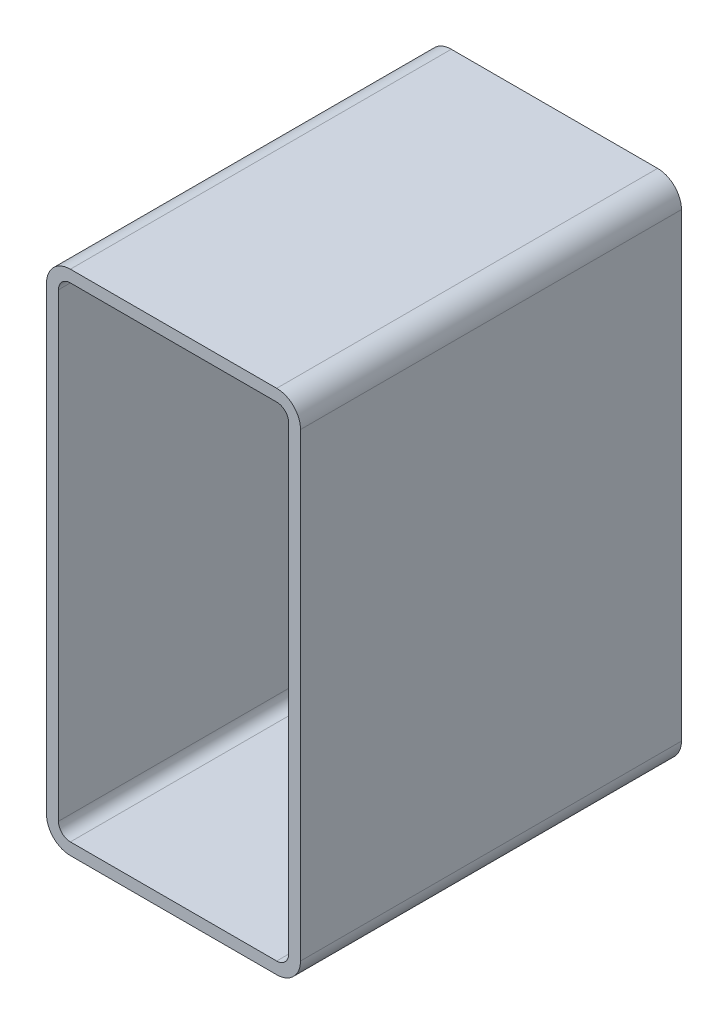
ISO-10303-21;
HEADER;
FILE_DESCRIPTION(('STEP AP214'),'2;1');
FILE_NAME('part.step','',(''),(''),'','','');
FILE_SCHEMA(('AUTOMOTIVE_DESIGN { 1 0 10303 214 1 1 1 1 }'));
ENDSEC;
DATA;
#1=APPLICATION_CONTEXT('core data for automotive mechanical design processes');
#2=APPLICATION_PROTOCOL_DEFINITION('international standard','automotive_design',2000,#1);
#3=PRODUCT_CONTEXT('',#1,'mechanical');
#4=PRODUCT('Part','Part','',(#3));
#5=PRODUCT_RELATED_PRODUCT_CATEGORY('part','',(#4));
#6=PRODUCT_DEFINITION_FORMATION('','',#4);
#7=PRODUCT_DEFINITION_CONTEXT('part definition',#1,'design');
#8=PRODUCT_DEFINITION('design','',#6,#7);
#9=PRODUCT_DEFINITION_SHAPE('','',#8);
#10=(LENGTH_UNIT() NAMED_UNIT(*) SI_UNIT(.MILLI.,.METRE.));
#11=(NAMED_UNIT(*) PLANE_ANGLE_UNIT() SI_UNIT($,.RADIAN.));
#12=(NAMED_UNIT(*) SI_UNIT($,.STERADIAN.) SOLID_ANGLE_UNIT());
#13=UNCERTAINTY_MEASURE_WITH_UNIT(LENGTH_MEASURE(1.E-05),#10,'distance_accuracy_value','');
#14=(GEOMETRIC_REPRESENTATION_CONTEXT(3) GLOBAL_UNCERTAINTY_ASSIGNED_CONTEXT((#13)) GLOBAL_UNIT_ASSIGNED_CONTEXT((#10,
#11,#12)) REPRESENTATION_CONTEXT('',''));
#15=CARTESIAN_POINT('',(0.,0.,0.));
#16=DIRECTION('',(0.,0.,1.));
#17=DIRECTION('',(1.,0.,0.));
#18=AXIS2_PLACEMENT_3D('',#15,#16,#17);
#19=CARTESIAN_POINT('',(20.4409404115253,389.132862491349,304.8));
#20=DIRECTION('',(0.,0.,1.));
#21=DIRECTION('',(1.,0.,0.));
#22=AXIS2_PLACEMENT_3D('',#19,#20,#21);
#23=PLANE('',#22);
#24=CARTESIAN_POINT('',(20.4409404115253,389.132862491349,304.8));
#25=DIRECTION('',(0.,0.,1.));
#26=DIRECTION('',(1.,0.,0.));
#27=AXIS2_PLACEMENT_3D('',#24,#25,#26);
#28=CIRCLE('',#27,19.05);
#29=CARTESIAN_POINT('',(20.4409404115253,408.182862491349,304.8));
#30=VERTEX_POINT('',#29);
#31=CARTESIAN_POINT('',(1.3909404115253,389.132862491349,304.8));
#32=VERTEX_POINT('',#31);
#33=EDGE_CURVE('E211',#30,#32,#28,.T.);
#34=ORIENTED_EDGE('',*,*,#33,.T.);
#35=DIRECTION('',(0.,-1.,0.));
#36=VECTOR('',#35,1.);
#37=CARTESIAN_POINT('',(1.3909404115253,20.8328624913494,304.8));
#38=LINE('',#37,#36);
#39=CARTESIAN_POINT('',(1.3909404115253,20.8328624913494,304.8));
#40=VERTEX_POINT('',#39);
#41=EDGE_CURVE('E214',#32,#40,#38,.T.);
#42=ORIENTED_EDGE('',*,*,#41,.T.);
#43=CARTESIAN_POINT('',(20.4409404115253,20.8328624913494,304.8));
#44=DIRECTION('',(0.,0.,1.));
#45=DIRECTION('',(1.,0.,0.));
#46=AXIS2_PLACEMENT_3D('',#43,#44,#45);
#47=CIRCLE('',#46,19.05);
#48=CARTESIAN_POINT('',(20.4409404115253,1.78286249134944,304.8));
#49=VERTEX_POINT('',#48);
#50=EDGE_CURVE('E217',#40,#49,#47,.T.);
#51=ORIENTED_EDGE('',*,*,#50,.T.);
#52=DIRECTION('',(1.,0.,0.));
#53=VECTOR('',#52,1.);
#54=CARTESIAN_POINT('',(185.540940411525,1.78286249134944,304.8));
#55=LINE('',#54,#53);
#56=CARTESIAN_POINT('',(185.540940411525,1.78286249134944,304.8));
#57=VERTEX_POINT('',#56);
#58=EDGE_CURVE('E219',#49,#57,#55,.T.);
#59=ORIENTED_EDGE('',*,*,#58,.T.);
#60=CARTESIAN_POINT('',(185.540940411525,20.8328624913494,304.8));
#61=DIRECTION('',(0.,0.,1.));
#62=DIRECTION('',(1.,0.,0.));
#63=AXIS2_PLACEMENT_3D('',#60,#61,#62);
#64=CIRCLE('',#63,19.05);
#65=CARTESIAN_POINT('',(204.590940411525,20.8328624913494,304.8));
#66=VERTEX_POINT('',#65);
#67=EDGE_CURVE('E221',#57,#66,#64,.T.);
#68=ORIENTED_EDGE('',*,*,#67,.T.);
#69=DIRECTION('',(0.,1.,0.));
#70=VECTOR('',#69,1.);
#71=CARTESIAN_POINT('',(204.590940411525,389.132862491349,304.8));
#72=LINE('',#71,#70);
#73=CARTESIAN_POINT('',(204.590940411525,389.132862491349,304.8));
#74=VERTEX_POINT('',#73);
#75=EDGE_CURVE('E223',#66,#74,#72,.T.);
#76=ORIENTED_EDGE('',*,*,#75,.T.);
#77=CARTESIAN_POINT('',(185.540940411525,389.132862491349,304.8));
#78=DIRECTION('',(0.,0.,1.));
#79=DIRECTION('',(1.,0.,0.));
#80=AXIS2_PLACEMENT_3D('',#77,#78,#79);
#81=CIRCLE('',#80,19.05);
#82=CARTESIAN_POINT('',(185.540940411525,408.182862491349,304.8));
#83=VERTEX_POINT('',#82);
#84=EDGE_CURVE('E225',#74,#83,#81,.T.);
#85=ORIENTED_EDGE('',*,*,#84,.T.);
#86=DIRECTION('',(-1.,0.,0.));
#87=VECTOR('',#86,1.);
#88=CARTESIAN_POINT('',(20.4409404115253,408.182862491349,304.8));
#89=LINE('',#88,#87);
#90=EDGE_CURVE('E227',#83,#30,#89,.T.);
#91=ORIENTED_EDGE('',*,*,#90,.T.);
#92=EDGE_LOOP('',(#34,#42,#51,#59,#68,#76,#85,#91));
#93=FACE_BOUND('',#92,.T.);
#94=DIRECTION('',(0.,-1.,0.));
#95=VECTOR('',#94,1.);
#96=CARTESIAN_POINT('',(10.9159404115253,20.8328624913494,304.8));
#97=LINE('',#96,#95);
#98=CARTESIAN_POINT('',(10.9159404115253,389.132862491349,304.8));
#99=VERTEX_POINT('',#98);
#100=CARTESIAN_POINT('',(10.9159404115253,20.8328624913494,304.8));
#101=VERTEX_POINT('',#100);
#102=EDGE_CURVE('E154',#99,#101,#97,.T.);
#103=ORIENTED_EDGE('',*,*,#102,.F.);
#104=CARTESIAN_POINT('',(20.4409404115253,389.132862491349,304.8));
#105=DIRECTION('',(0.,0.,1.));
#106=DIRECTION('',(1.,0.,0.));
#107=AXIS2_PLACEMENT_3D('',#104,#105,#106);
#108=CIRCLE('',#107,9.525);
#109=CARTESIAN_POINT('',(20.4409404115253,398.657862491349,304.8));
#110=VERTEX_POINT('',#109);
#111=EDGE_CURVE('E146',#110,#99,#108,.T.);
#112=ORIENTED_EDGE('',*,*,#111,.F.);
#113=DIRECTION('',(-1.,0.,0.));
#114=VECTOR('',#113,1.);
#115=CARTESIAN_POINT('',(20.4409404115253,398.657862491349,304.8));
#116=LINE('',#115,#114);
#117=CARTESIAN_POINT('',(185.540940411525,398.657862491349,304.8));
#118=VERTEX_POINT('',#117);
#119=EDGE_CURVE('E179',#118,#110,#116,.T.);
#120=ORIENTED_EDGE('',*,*,#119,.F.);
#121=CARTESIAN_POINT('',(185.540940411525,389.132862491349,304.8));
#122=DIRECTION('',(0.,0.,1.));
#123=DIRECTION('',(1.,0.,0.));
#124=AXIS2_PLACEMENT_3D('',#121,#122,#123);
#125=CIRCLE('',#124,9.52500000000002);
#126=CARTESIAN_POINT('',(195.065940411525,389.132862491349,304.8));
#127=VERTEX_POINT('',#126);
#128=EDGE_CURVE('E177',#127,#118,#125,.T.);
#129=ORIENTED_EDGE('',*,*,#128,.F.);
#130=DIRECTION('',(0.,1.,0.));
#131=VECTOR('',#130,1.);
#132=CARTESIAN_POINT('',(195.065940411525,389.132862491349,304.8));
#133=LINE('',#132,#131);
#134=CARTESIAN_POINT('',(195.065940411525,20.8328624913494,304.8));
#135=VERTEX_POINT('',#134);
#136=EDGE_CURVE('E175',#135,#127,#133,.T.);
#137=ORIENTED_EDGE('',*,*,#136,.F.);
#138=CARTESIAN_POINT('',(185.540940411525,20.8328624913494,304.8));
#139=DIRECTION('',(0.,0.,1.));
#140=DIRECTION('',(1.,0.,0.));
#141=AXIS2_PLACEMENT_3D('',#138,#139,#140);
#142=CIRCLE('',#141,9.52500000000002);
#143=CARTESIAN_POINT('',(185.540940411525,11.3078624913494,304.8));
#144=VERTEX_POINT('',#143);
#145=EDGE_CURVE('E173',#144,#135,#142,.T.);
#146=ORIENTED_EDGE('',*,*,#145,.F.);
#147=DIRECTION('',(1.,0.,0.));
#148=VECTOR('',#147,1.);
#149=CARTESIAN_POINT('',(185.540940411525,11.3078624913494,304.8));
#150=LINE('',#149,#148);
#151=CARTESIAN_POINT('',(20.4409404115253,11.3078624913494,304.8));
#152=VERTEX_POINT('',#151);
#153=EDGE_CURVE('E169',#152,#144,#150,.T.);
#154=ORIENTED_EDGE('',*,*,#153,.F.);
#155=CARTESIAN_POINT('',(20.4409404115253,20.8328624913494,304.8));
#156=DIRECTION('',(0.,0.,1.));
#157=DIRECTION('',(1.,0.,0.));
#158=AXIS2_PLACEMENT_3D('',#155,#156,#157);
#159=CIRCLE('',#158,9.525);
#160=EDGE_CURVE('E167',#101,#152,#159,.T.);
#161=ORIENTED_EDGE('',*,*,#160,.F.);
#162=EDGE_LOOP('',(#103,#112,#120,#129,#137,#146,#154,#161));
#163=FACE_BOUND('',#162,.T.);
#164=ADVANCED_FACE('F33',(#93,#163),#23,.T.);
#165=CARTESIAN_POINT('',(20.4409404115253,389.132862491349,0.));
#166=DIRECTION('',(0.,0.,1.));
#167=DIRECTION('',(1.,0.,0.));
#168=AXIS2_PLACEMENT_3D('',#165,#166,#167);
#169=PLANE('',#168);
#170=CARTESIAN_POINT('',(20.4409404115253,389.132862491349,0.));
#171=DIRECTION('',(0.,0.,1.));
#172=DIRECTION('',(1.,0.,0.));
#173=AXIS2_PLACEMENT_3D('',#170,#171,#172);
#174=CIRCLE('',#173,19.05);
#175=CARTESIAN_POINT('',(20.4409404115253,408.182862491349,0.));
#176=VERTEX_POINT('',#175);
#177=CARTESIAN_POINT('',(1.3909404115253,389.132862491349,0.));
#178=VERTEX_POINT('',#177);
#179=EDGE_CURVE('E162',#176,#178,#174,.T.);
#180=ORIENTED_EDGE('',*,*,#179,.F.);
#181=DIRECTION('',(-1.,0.,0.));
#182=VECTOR('',#181,1.);
#183=CARTESIAN_POINT('',(20.4409404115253,408.182862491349,0.));
#184=LINE('',#183,#182);
#185=CARTESIAN_POINT('',(185.540940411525,408.182862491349,0.));
#186=VERTEX_POINT('',#185);
#187=EDGE_CURVE('E215',#186,#176,#184,.T.);
#188=ORIENTED_EDGE('',*,*,#187,.F.);
#189=CARTESIAN_POINT('',(185.540940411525,389.132862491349,0.));
#190=DIRECTION('',(0.,0.,1.));
#191=DIRECTION('',(1.,0.,0.));
#192=AXIS2_PLACEMENT_3D('',#189,#190,#191);
#193=CIRCLE('',#192,19.05);
#194=CARTESIAN_POINT('',(204.590940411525,389.132862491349,0.));
#195=VERTEX_POINT('',#194);
#196=EDGE_CURVE('E242',#195,#186,#193,.T.);
#197=ORIENTED_EDGE('',*,*,#196,.F.);
#198=DIRECTION('',(0.,1.,0.));
#199=VECTOR('',#198,1.);
#200=CARTESIAN_POINT('',(204.590940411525,389.132862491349,0.));
#201=LINE('',#200,#199);
#202=CARTESIAN_POINT('',(204.590940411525,20.8328624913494,0.));
#203=VERTEX_POINT('',#202);
#204=EDGE_CURVE('E240',#203,#195,#201,.T.);
#205=ORIENTED_EDGE('',*,*,#204,.F.);
#206=CARTESIAN_POINT('',(185.540940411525,20.8328624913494,0.));
#207=DIRECTION('',(0.,0.,1.));
#208=DIRECTION('',(1.,0.,0.));
#209=AXIS2_PLACEMENT_3D('',#206,#207,#208);
#210=CIRCLE('',#209,19.05);
#211=CARTESIAN_POINT('',(185.540940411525,1.78286249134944,0.));
#212=VERTEX_POINT('',#211);
#213=EDGE_CURVE('E238',#212,#203,#210,.T.);
#214=ORIENTED_EDGE('',*,*,#213,.F.);
#215=DIRECTION('',(1.,0.,0.));
#216=VECTOR('',#215,1.);
#217=CARTESIAN_POINT('',(185.540940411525,1.78286249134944,0.));
#218=LINE('',#217,#216);
#219=CARTESIAN_POINT('',(20.4409404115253,1.78286249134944,0.));
#220=VERTEX_POINT('',#219);
#221=EDGE_CURVE('E236',#220,#212,#218,.T.);
#222=ORIENTED_EDGE('',*,*,#221,.F.);
#223=CARTESIAN_POINT('',(20.4409404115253,20.8328624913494,0.));
#224=DIRECTION('',(0.,0.,1.));
#225=DIRECTION('',(1.,0.,0.));
#226=AXIS2_PLACEMENT_3D('',#223,#224,#225);
#227=CIRCLE('',#226,19.05);
#228=CARTESIAN_POINT('',(1.3909404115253,20.8328624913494,0.));
#229=VERTEX_POINT('',#228);
#230=EDGE_CURVE('E234',#229,#220,#227,.T.);
#231=ORIENTED_EDGE('',*,*,#230,.F.);
#232=DIRECTION('',(0.,-1.,0.));
#233=VECTOR('',#232,1.);
#234=CARTESIAN_POINT('',(1.3909404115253,20.8328624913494,0.));
#235=LINE('',#234,#233);
#236=EDGE_CURVE('E232',#178,#229,#235,.T.);
#237=ORIENTED_EDGE('',*,*,#236,.F.);
#238=EDGE_LOOP('',(#180,#188,#197,#205,#214,#222,#231,#237));
#239=FACE_BOUND('',#238,.T.);
#240=CARTESIAN_POINT('',(20.4409404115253,389.132862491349,0.));
#241=DIRECTION('',(0.,0.,1.));
#242=DIRECTION('',(1.,0.,0.));
#243=AXIS2_PLACEMENT_3D('',#240,#241,#242);
#244=CIRCLE('',#243,9.525);
#245=CARTESIAN_POINT('',(20.4409404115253,398.657862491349,0.));
#246=VERTEX_POINT('',#245);
#247=CARTESIAN_POINT('',(10.9159404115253,389.132862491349,0.));
#248=VERTEX_POINT('',#247);
#249=EDGE_CURVE('E56',#246,#248,#244,.T.);
#250=ORIENTED_EDGE('',*,*,#249,.T.);
#251=DIRECTION('',(0.,-1.,0.));
#252=VECTOR('',#251,1.);
#253=CARTESIAN_POINT('',(10.9159404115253,20.8328624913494,0.));
#254=LINE('',#253,#252);
#255=CARTESIAN_POINT('',(10.9159404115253,20.8328624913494,0.));
#256=VERTEX_POINT('',#255);
#257=EDGE_CURVE('E161',#248,#256,#254,.T.);
#258=ORIENTED_EDGE('',*,*,#257,.T.);
#259=CARTESIAN_POINT('',(20.4409404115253,20.8328624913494,0.));
#260=DIRECTION('',(0.,0.,1.));
#261=DIRECTION('',(1.,0.,0.));
#262=AXIS2_PLACEMENT_3D('',#259,#260,#261);
#263=CIRCLE('',#262,9.525);
#264=CARTESIAN_POINT('',(20.4409404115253,11.3078624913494,0.));
#265=VERTEX_POINT('',#264);
#266=EDGE_CURVE('E183',#256,#265,#263,.T.);
#267=ORIENTED_EDGE('',*,*,#266,.T.);
#268=DIRECTION('',(1.,0.,0.));
#269=VECTOR('',#268,1.);
#270=CARTESIAN_POINT('',(185.540940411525,11.3078624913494,0.));
#271=LINE('',#270,#269);
#272=CARTESIAN_POINT('',(185.540940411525,11.3078624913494,0.));
#273=VERTEX_POINT('',#272);
#274=EDGE_CURVE('E186',#265,#273,#271,.T.);
#275=ORIENTED_EDGE('',*,*,#274,.T.);
#276=CARTESIAN_POINT('',(185.540940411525,20.8328624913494,0.));
#277=DIRECTION('',(0.,0.,1.));
#278=DIRECTION('',(1.,0.,0.));
#279=AXIS2_PLACEMENT_3D('',#276,#277,#278);
#280=CIRCLE('',#279,9.52500000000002);
#281=CARTESIAN_POINT('',(195.065940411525,20.8328624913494,0.));
#282=VERTEX_POINT('',#281);
#283=EDGE_CURVE('E189',#273,#282,#280,.T.);
#284=ORIENTED_EDGE('',*,*,#283,.T.);
#285=DIRECTION('',(0.,1.,0.));
#286=VECTOR('',#285,1.);
#287=CARTESIAN_POINT('',(195.065940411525,389.132862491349,0.));
#288=LINE('',#287,#286);
#289=CARTESIAN_POINT('',(195.065940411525,389.132862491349,0.));
#290=VERTEX_POINT('',#289);
#291=EDGE_CURVE('E192',#282,#290,#288,.T.);
#292=ORIENTED_EDGE('',*,*,#291,.T.);
#293=CARTESIAN_POINT('',(185.540940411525,389.132862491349,0.));
#294=DIRECTION('',(0.,0.,1.));
#295=DIRECTION('',(1.,0.,0.));
#296=AXIS2_PLACEMENT_3D('',#293,#294,#295);
#297=CIRCLE('',#296,9.52500000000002);
#298=CARTESIAN_POINT('',(185.540940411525,398.657862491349,0.));
#299=VERTEX_POINT('',#298);
#300=EDGE_CURVE('E195',#290,#299,#297,.T.);
#301=ORIENTED_EDGE('',*,*,#300,.T.);
#302=DIRECTION('',(-1.,0.,0.));
#303=VECTOR('',#302,1.);
#304=CARTESIAN_POINT('',(20.4409404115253,398.657862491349,0.));
#305=LINE('',#304,#303);
#306=EDGE_CURVE('E155',#299,#246,#305,.T.);
#307=ORIENTED_EDGE('',*,*,#306,.T.);
#308=EDGE_LOOP('',(#250,#258,#267,#275,#284,#292,#301,#307));
#309=FACE_BOUND('',#308,.T.);
#310=ADVANCED_FACE('F272',(#239,#309),#169,.F.);
#311=CARTESIAN_POINT('',(20.4409404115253,389.132862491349,304.8));
#312=DIRECTION('',(0.,0.,-1.));
#313=DIRECTION('',(-1.,0.,0.));
#314=AXIS2_PLACEMENT_3D('',#311,#312,#313);
#315=CYLINDRICAL_SURFACE('',#314,19.05);
#316=ORIENTED_EDGE('',*,*,#179,.T.);
#317=DIRECTION('',(0.,0.,-1.));
#318=VECTOR('',#317,1.);
#319=CARTESIAN_POINT('',(1.3909404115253,389.132862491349,304.8));
#320=LINE('',#319,#318);
#321=EDGE_CURVE('E11',#32,#178,#320,.T.);
#322=ORIENTED_EDGE('',*,*,#321,.F.);
#323=ORIENTED_EDGE('',*,*,#33,.F.);
#324=DIRECTION('',(0.,0.,-1.));
#325=VECTOR('',#324,1.);
#326=CARTESIAN_POINT('',(20.4409404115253,408.182862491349,304.8));
#327=LINE('',#326,#325);
#328=EDGE_CURVE('E229',#30,#176,#327,.T.);
#329=ORIENTED_EDGE('',*,*,#328,.T.);
#330=EDGE_LOOP('',(#316,#322,#323,#329));
#331=FACE_BOUND('',#330,.T.);
#332=ADVANCED_FACE('F35',(#331),#315,.T.);
#333=CARTESIAN_POINT('',(1.3909404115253,20.8328624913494,304.8));
#334=DIRECTION('',(1.,0.,0.));
#335=DIRECTION('',(0.,0.,-1.));
#336=AXIS2_PLACEMENT_3D('',#333,#334,#335);
#337=PLANE('',#336);
#338=ORIENTED_EDGE('',*,*,#236,.T.);
#339=DIRECTION('',(0.,0.,-1.));
#340=VECTOR('',#339,1.);
#341=CARTESIAN_POINT('',(1.3909404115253,20.8328624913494,304.8));
#342=LINE('',#341,#340);
#343=EDGE_CURVE('E41',#40,#229,#342,.T.);
#344=ORIENTED_EDGE('',*,*,#343,.F.);
#345=ORIENTED_EDGE('',*,*,#41,.F.);
#346=ORIENTED_EDGE('',*,*,#321,.T.);
#347=EDGE_LOOP('',(#338,#344,#345,#346));
#348=FACE_BOUND('',#347,.T.);
#349=ADVANCED_FACE('F289',(#348),#337,.F.);
#350=CARTESIAN_POINT('',(20.4409404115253,20.8328624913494,304.8));
#351=DIRECTION('',(0.,0.,-1.));
#352=DIRECTION('',(-1.,0.,0.));
#353=AXIS2_PLACEMENT_3D('',#350,#351,#352);
#354=CYLINDRICAL_SURFACE('',#353,19.05);
#355=ORIENTED_EDGE('',*,*,#230,.T.);
#356=DIRECTION('',(0.,0.,-1.));
#357=VECTOR('',#356,1.);
#358=CARTESIAN_POINT('',(20.4409404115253,1.78286249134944,304.8));
#359=LINE('',#358,#357);
#360=EDGE_CURVE('E259',#49,#220,#359,.T.);
#361=ORIENTED_EDGE('',*,*,#360,.F.);
#362=ORIENTED_EDGE('',*,*,#50,.F.);
#363=ORIENTED_EDGE('',*,*,#343,.T.);
#364=EDGE_LOOP('',(#355,#361,#362,#363));
#365=FACE_BOUND('',#364,.T.);
#366=ADVANCED_FACE('F266',(#365),#354,.T.);
#367=CARTESIAN_POINT('',(185.540940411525,1.78286249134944,304.8));
#368=DIRECTION('',(0.,1.,0.));
#369=DIRECTION('',(0.,0.,1.));
#370=AXIS2_PLACEMENT_3D('',#367,#368,#369);
#371=PLANE('',#370);
#372=ORIENTED_EDGE('',*,*,#221,.T.);
#373=DIRECTION('',(0.,0.,-1.));
#374=VECTOR('',#373,1.);
#375=CARTESIAN_POINT('',(185.540940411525,1.78286249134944,304.8));
#376=LINE('',#375,#374);
#377=EDGE_CURVE('E256',#57,#212,#376,.T.);
#378=ORIENTED_EDGE('',*,*,#377,.F.);
#379=ORIENTED_EDGE('',*,*,#58,.F.);
#380=ORIENTED_EDGE('',*,*,#360,.T.);
#381=EDGE_LOOP('',(#372,#378,#379,#380));
#382=FACE_BOUND('',#381,.T.);
#383=ADVANCED_FACE('F278',(#382),#371,.F.);
#384=CARTESIAN_POINT('',(185.540940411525,20.8328624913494,304.8));
#385=DIRECTION('',(0.,0.,-1.));
#386=DIRECTION('',(-1.,0.,0.));
#387=AXIS2_PLACEMENT_3D('',#384,#385,#386);
#388=CYLINDRICAL_SURFACE('',#387,19.05);
#389=ORIENTED_EDGE('',*,*,#213,.T.);
#390=DIRECTION('',(0.,0.,-1.));
#391=VECTOR('',#390,1.);
#392=CARTESIAN_POINT('',(204.590940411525,20.8328624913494,304.8));
#393=LINE('',#392,#391);
#394=EDGE_CURVE('E253',#66,#203,#393,.T.);
#395=ORIENTED_EDGE('',*,*,#394,.F.);
#396=ORIENTED_EDGE('',*,*,#67,.F.);
#397=ORIENTED_EDGE('',*,*,#377,.T.);
#398=EDGE_LOOP('',(#389,#395,#396,#397));
#399=FACE_BOUND('',#398,.T.);
#400=ADVANCED_FACE('F282',(#399),#388,.T.);
#401=CARTESIAN_POINT('',(204.590940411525,389.132862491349,304.8));
#402=DIRECTION('',(-1.,0.,0.));
#403=DIRECTION('',(0.,0.,1.));
#404=AXIS2_PLACEMENT_3D('',#401,#402,#403);
#405=PLANE('',#404);
#406=ORIENTED_EDGE('',*,*,#204,.T.);
#407=DIRECTION('',(0.,0.,-1.));
#408=VECTOR('',#407,1.);
#409=CARTESIAN_POINT('',(204.590940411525,389.132862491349,304.8));
#410=LINE('',#409,#408);
#411=EDGE_CURVE('E250',#74,#195,#410,.T.);
#412=ORIENTED_EDGE('',*,*,#411,.F.);
#413=ORIENTED_EDGE('',*,*,#75,.F.);
#414=ORIENTED_EDGE('',*,*,#394,.T.);
#415=EDGE_LOOP('',(#406,#412,#413,#414));
#416=FACE_BOUND('',#415,.T.);
#417=ADVANCED_FACE('F302',(#416),#405,.F.);
#418=CARTESIAN_POINT('',(185.540940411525,389.132862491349,304.8));
#419=DIRECTION('',(0.,0.,-1.));
#420=DIRECTION('',(-1.,0.,0.));
#421=AXIS2_PLACEMENT_3D('',#418,#419,#420);
#422=CYLINDRICAL_SURFACE('',#421,19.05);
#423=ORIENTED_EDGE('',*,*,#196,.T.);
#424=DIRECTION('',(0.,0.,-1.));
#425=VECTOR('',#424,1.);
#426=CARTESIAN_POINT('',(185.540940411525,408.182862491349,304.8));
#427=LINE('',#426,#425);
#428=EDGE_CURVE('E247',#83,#186,#427,.T.);
#429=ORIENTED_EDGE('',*,*,#428,.F.);
#430=ORIENTED_EDGE('',*,*,#84,.F.);
#431=ORIENTED_EDGE('',*,*,#411,.T.);
#432=EDGE_LOOP('',(#423,#429,#430,#431));
#433=FACE_BOUND('',#432,.T.);
#434=ADVANCED_FACE('F300',(#433),#422,.T.);
#435=CARTESIAN_POINT('',(20.4409404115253,408.182862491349,304.8));
#436=DIRECTION('',(0.,-1.,0.));
#437=DIRECTION('',(0.,0.,-1.));
#438=AXIS2_PLACEMENT_3D('',#435,#436,#437);
#439=PLANE('',#438);
#440=ORIENTED_EDGE('',*,*,#187,.T.);
#441=ORIENTED_EDGE('',*,*,#328,.F.);
#442=ORIENTED_EDGE('',*,*,#90,.F.);
#443=ORIENTED_EDGE('',*,*,#428,.T.);
#444=EDGE_LOOP('',(#440,#441,#442,#443));
#445=FACE_BOUND('',#444,.T.);
#446=ADVANCED_FACE('F295',(#445),#439,.F.);
#447=CARTESIAN_POINT('',(20.4409404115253,389.132862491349,304.8));
#448=DIRECTION('',(0.,0.,-1.));
#449=DIRECTION('',(-1.,0.,0.));
#450=AXIS2_PLACEMENT_3D('',#447,#448,#449);
#451=CYLINDRICAL_SURFACE('',#450,9.525);
#452=ORIENTED_EDGE('',*,*,#249,.F.);
#453=DIRECTION('',(0.,0.,-1.));
#454=VECTOR('',#453,1.);
#455=CARTESIAN_POINT('',(20.4409404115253,398.657862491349,304.8));
#456=LINE('',#455,#454);
#457=EDGE_CURVE('E150',#110,#246,#456,.T.);
#458=ORIENTED_EDGE('',*,*,#457,.F.);
#459=ORIENTED_EDGE('',*,*,#111,.T.);
#460=DIRECTION('',(0.,0.,-1.));
#461=VECTOR('',#460,1.);
#462=CARTESIAN_POINT('',(10.9159404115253,389.132862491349,304.8));
#463=LINE('',#462,#461);
#464=EDGE_CURVE('E149',#99,#248,#463,.T.);
#465=ORIENTED_EDGE('',*,*,#464,.T.);
#466=EDGE_LOOP('',(#452,#458,#459,#465));
#467=FACE_BOUND('',#466,.T.);
#468=ADVANCED_FACE('F148',(#467),#451,.F.);
#469=CARTESIAN_POINT('',(10.9159404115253,20.8328624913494,304.8));
#470=DIRECTION('',(1.,0.,0.));
#471=DIRECTION('',(0.,0.,-1.));
#472=AXIS2_PLACEMENT_3D('',#469,#470,#471);
#473=PLANE('',#472);
#474=ORIENTED_EDGE('',*,*,#257,.F.);
#475=ORIENTED_EDGE('',*,*,#464,.F.);
#476=ORIENTED_EDGE('',*,*,#102,.T.);
#477=DIRECTION('',(0.,0.,-1.));
#478=VECTOR('',#477,1.);
#479=CARTESIAN_POINT('',(10.9159404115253,20.8328624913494,304.8));
#480=LINE('',#479,#478);
#481=EDGE_CURVE('E163',#101,#256,#480,.T.);
#482=ORIENTED_EDGE('',*,*,#481,.T.);
#483=EDGE_LOOP('',(#474,#475,#476,#482));
#484=FACE_BOUND('',#483,.T.);
#485=ADVANCED_FACE('F158',(#484),#473,.T.);
#486=CARTESIAN_POINT('',(20.4409404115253,20.8328624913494,304.8));
#487=DIRECTION('',(0.,0.,-1.));
#488=DIRECTION('',(-1.,0.,0.));
#489=AXIS2_PLACEMENT_3D('',#486,#487,#488);
#490=CYLINDRICAL_SURFACE('',#489,9.525);
#491=ORIENTED_EDGE('',*,*,#266,.F.);
#492=ORIENTED_EDGE('',*,*,#481,.F.);
#493=ORIENTED_EDGE('',*,*,#160,.T.);
#494=DIRECTION('',(0.,0.,-1.));
#495=VECTOR('',#494,1.);
#496=CARTESIAN_POINT('',(20.4409404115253,11.3078624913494,304.8));
#497=LINE('',#496,#495);
#498=EDGE_CURVE('E208',#152,#265,#497,.T.);
#499=ORIENTED_EDGE('',*,*,#498,.T.);
#500=EDGE_LOOP('',(#491,#492,#493,#499));
#501=FACE_BOUND('',#500,.T.);
#502=ADVANCED_FACE('F327',(#501),#490,.F.);
#503=CARTESIAN_POINT('',(185.540940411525,11.3078624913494,304.8));
#504=DIRECTION('',(0.,1.,0.));
#505=DIRECTION('',(0.,0.,1.));
#506=AXIS2_PLACEMENT_3D('',#503,#504,#505);
#507=PLANE('',#506);
#508=ORIENTED_EDGE('',*,*,#274,.F.);
#509=ORIENTED_EDGE('',*,*,#498,.F.);
#510=ORIENTED_EDGE('',*,*,#153,.T.);
#511=DIRECTION('',(0.,0.,-1.));
#512=VECTOR('',#511,1.);
#513=CARTESIAN_POINT('',(185.540940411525,11.3078624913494,304.8));
#514=LINE('',#513,#512);
#515=EDGE_CURVE('E206',#144,#273,#514,.T.);
#516=ORIENTED_EDGE('',*,*,#515,.T.);
#517=EDGE_LOOP('',(#508,#509,#510,#516));
#518=FACE_BOUND('',#517,.T.);
#519=ADVANCED_FACE('F331',(#518),#507,.T.);
#520=CARTESIAN_POINT('',(185.540940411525,20.8328624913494,304.8));
#521=DIRECTION('',(0.,0.,-1.));
#522=DIRECTION('',(-1.,0.,0.));
#523=AXIS2_PLACEMENT_3D('',#520,#521,#522);
#524=CYLINDRICAL_SURFACE('',#523,9.52500000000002);
#525=ORIENTED_EDGE('',*,*,#283,.F.);
#526=ORIENTED_EDGE('',*,*,#515,.F.);
#527=ORIENTED_EDGE('',*,*,#145,.T.);
#528=DIRECTION('',(0.,0.,-1.));
#529=VECTOR('',#528,1.);
#530=CARTESIAN_POINT('',(195.065940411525,20.8328624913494,304.8));
#531=LINE('',#530,#529);
#532=EDGE_CURVE('E204',#135,#282,#531,.T.);
#533=ORIENTED_EDGE('',*,*,#532,.T.);
#534=EDGE_LOOP('',(#525,#526,#527,#533));
#535=FACE_BOUND('',#534,.T.);
#536=ADVANCED_FACE('F337',(#535),#524,.F.);
#537=CARTESIAN_POINT('',(195.065940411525,389.132862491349,304.8));
#538=DIRECTION('',(-1.,0.,0.));
#539=DIRECTION('',(0.,0.,1.));
#540=AXIS2_PLACEMENT_3D('',#537,#538,#539);
#541=PLANE('',#540);
#542=ORIENTED_EDGE('',*,*,#291,.F.);
#543=ORIENTED_EDGE('',*,*,#532,.F.);
#544=ORIENTED_EDGE('',*,*,#136,.T.);
#545=DIRECTION('',(0.,0.,-1.));
#546=VECTOR('',#545,1.);
#547=CARTESIAN_POINT('',(195.065940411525,389.132862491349,304.8));
#548=LINE('',#547,#546);
#549=EDGE_CURVE('E202',#127,#290,#548,.T.);
#550=ORIENTED_EDGE('',*,*,#549,.T.);
#551=EDGE_LOOP('',(#542,#543,#544,#550));
#552=FACE_BOUND('',#551,.T.);
#553=ADVANCED_FACE('F341',(#552),#541,.T.);
#554=CARTESIAN_POINT('',(185.540940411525,389.132862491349,304.8));
#555=DIRECTION('',(0.,0.,-1.));
#556=DIRECTION('',(-1.,0.,0.));
#557=AXIS2_PLACEMENT_3D('',#554,#555,#556);
#558=CYLINDRICAL_SURFACE('',#557,9.52500000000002);
#559=ORIENTED_EDGE('',*,*,#300,.F.);
#560=ORIENTED_EDGE('',*,*,#549,.F.);
#561=ORIENTED_EDGE('',*,*,#128,.T.);
#562=DIRECTION('',(0.,0.,-1.));
#563=VECTOR('',#562,1.);
#564=CARTESIAN_POINT('',(185.540940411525,398.657862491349,304.8));
#565=LINE('',#564,#563);
#566=EDGE_CURVE('E48',#118,#299,#565,.T.);
#567=ORIENTED_EDGE('',*,*,#566,.T.);
#568=EDGE_LOOP('',(#559,#560,#561,#567));
#569=FACE_BOUND('',#568,.T.);
#570=ADVANCED_FACE('F345',(#569),#558,.F.);
#571=CARTESIAN_POINT('',(20.4409404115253,398.657862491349,304.8));
#572=DIRECTION('',(0.,-1.,0.));
#573=DIRECTION('',(0.,0.,-1.));
#574=AXIS2_PLACEMENT_3D('',#571,#572,#573);
#575=PLANE('',#574);
#576=ORIENTED_EDGE('',*,*,#306,.F.);
#577=ORIENTED_EDGE('',*,*,#566,.F.);
#578=ORIENTED_EDGE('',*,*,#119,.T.);
#579=ORIENTED_EDGE('',*,*,#457,.T.);
#580=EDGE_LOOP('',(#576,#577,#578,#579));
#581=FACE_BOUND('',#580,.T.);
#582=ADVANCED_FACE('F349',(#581),#575,.T.);
#583=CLOSED_SHELL('',(#164,#310,#332,#349,#366,#383,#400,#417,#434,#446,#468,#485,#502,#519,
#536,#553,#570,#582));
#584=MANIFOLD_SOLID_BREP('B2',#583);
#585=ADVANCED_BREP_SHAPE_REPRESENTATION('',(#18,#584),#14);
#586=SHAPE_DEFINITION_REPRESENTATION(#9,#585);
ENDSEC;
END-ISO-10303-21;
